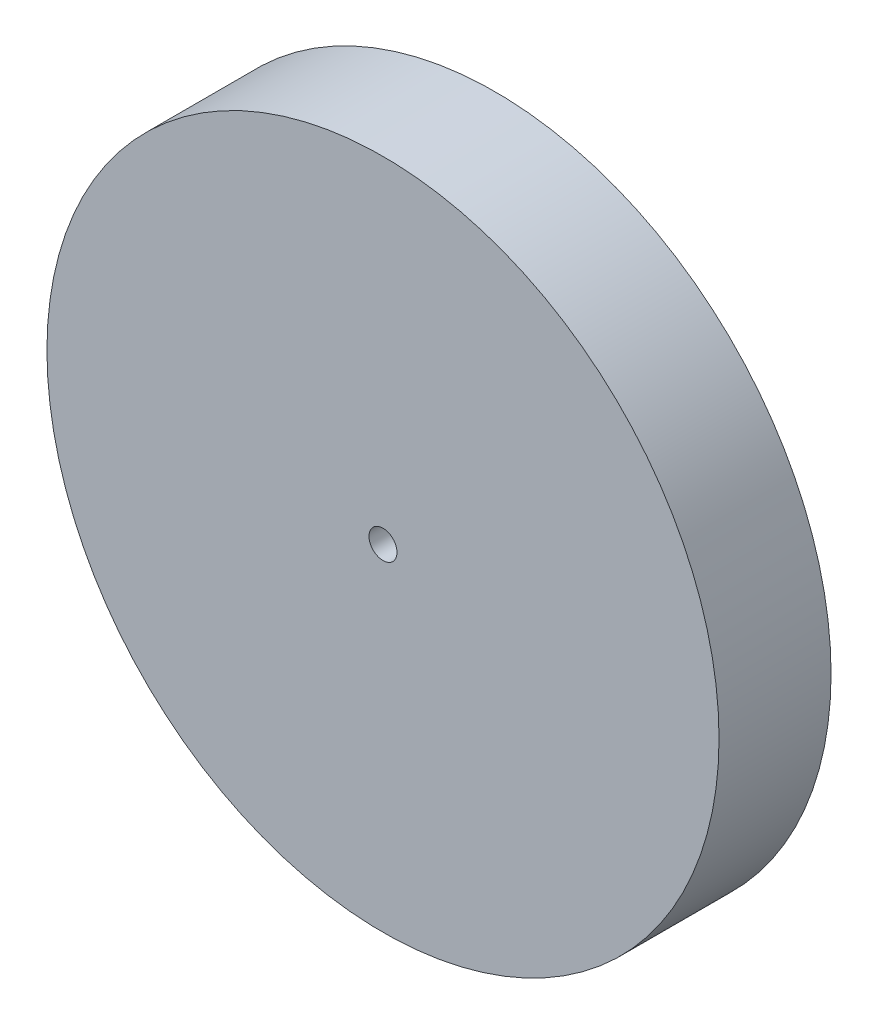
ISO-10303-21;
HEADER;
FILE_DESCRIPTION(('STEP AP214'),'2;1');
FILE_NAME('part.step','',(''),(''),'','','');
FILE_SCHEMA(('AUTOMOTIVE_DESIGN { 1 0 10303 214 1 1 1 1 }'));
ENDSEC;
DATA;
#1=APPLICATION_CONTEXT('core data for automotive mechanical design processes');
#2=APPLICATION_PROTOCOL_DEFINITION('international standard','automotive_design',2000,#1);
#3=PRODUCT_CONTEXT('',#1,'mechanical');
#4=PRODUCT('Part','Part','',(#3));
#5=PRODUCT_RELATED_PRODUCT_CATEGORY('part','',(#4));
#6=PRODUCT_DEFINITION_FORMATION('','',#4);
#7=PRODUCT_DEFINITION_CONTEXT('part definition',#1,'design');
#8=PRODUCT_DEFINITION('design','',#6,#7);
#9=PRODUCT_DEFINITION_SHAPE('','',#8);
#10=(LENGTH_UNIT() NAMED_UNIT(*) SI_UNIT(.MILLI.,.METRE.));
#11=(NAMED_UNIT(*) PLANE_ANGLE_UNIT() SI_UNIT($,.RADIAN.));
#12=(NAMED_UNIT(*) SI_UNIT($,.STERADIAN.) SOLID_ANGLE_UNIT());
#13=UNCERTAINTY_MEASURE_WITH_UNIT(LENGTH_MEASURE(1.E-05),#10,'distance_accuracy_value','');
#14=(GEOMETRIC_REPRESENTATION_CONTEXT(3) GLOBAL_UNCERTAINTY_ASSIGNED_CONTEXT((#13)) GLOBAL_UNIT_ASSIGNED_CONTEXT((#10,
#11,#12)) REPRESENTATION_CONTEXT('',''));
#15=CARTESIAN_POINT('',(0.,0.,0.));
#16=DIRECTION('',(0.,0.,1.));
#17=DIRECTION('',(1.,0.,0.));
#18=AXIS2_PLACEMENT_3D('',#15,#16,#17);
#19=CARTESIAN_POINT('',(0.,0.,6.35));
#20=DIRECTION('',(0.,0.,-1.));
#21=DIRECTION('',(-1.,0.,0.));
#22=AXIS2_PLACEMENT_3D('',#19,#20,#21);
#23=CYLINDRICAL_SURFACE('',#22,38.1);
#24=CARTESIAN_POINT('',(0.,0.,6.35));
#25=DIRECTION('',(0.,0.,1.));
#26=DIRECTION('',(1.,0.,0.));
#27=AXIS2_PLACEMENT_3D('',#24,#25,#26);
#28=CIRCLE('',#27,38.1);
#29=CARTESIAN_POINT('',(38.1,0.,6.35));
#30=VERTEX_POINT('',#29);
#31=EDGE_CURVE('E10',#30,#30,#28,.T.);
#32=ORIENTED_EDGE('',*,*,#31,.F.);
#33=EDGE_LOOP('',(#32));
#34=FACE_BOUND('',#33,.T.);
#35=CARTESIAN_POINT('',(0.,0.,-6.35));
#36=DIRECTION('',(0.,0.,1.));
#37=DIRECTION('',(1.,0.,0.));
#38=AXIS2_PLACEMENT_3D('',#35,#36,#37);
#39=CIRCLE('',#38,38.1);
#40=CARTESIAN_POINT('',(38.1,0.,-6.35));
#41=VERTEX_POINT('',#40);
#42=EDGE_CURVE('E46',#41,#41,#39,.T.);
#43=ORIENTED_EDGE('',*,*,#42,.T.);
#44=EDGE_LOOP('',(#43));
#45=FACE_BOUND('',#44,.T.);
#46=ADVANCED_FACE('F39',(#34,#45),#23,.T.);
#47=CARTESIAN_POINT('',(0.,0.,6.35));
#48=DIRECTION('',(0.,0.,1.));
#49=DIRECTION('',(1.,0.,0.));
#50=AXIS2_PLACEMENT_3D('',#47,#48,#49);
#51=PLANE('',#50);
#52=CARTESIAN_POINT('',(0.,0.,6.35));
#53=DIRECTION('',(0.,0.,1.));
#54=DIRECTION('',(1.,0.,0.));
#55=AXIS2_PLACEMENT_3D('',#52,#53,#54);
#56=CIRCLE('',#55,1.5875);
#57=CARTESIAN_POINT('',(1.5875,0.,6.35));
#58=VERTEX_POINT('',#57);
#59=EDGE_CURVE('E51',#58,#58,#56,.T.);
#60=ORIENTED_EDGE('',*,*,#59,.F.);
#61=EDGE_LOOP('',(#60));
#62=FACE_BOUND('',#61,.T.);
#63=ORIENTED_EDGE('',*,*,#31,.T.);
#64=EDGE_LOOP('',(#63));
#65=FACE_BOUND('',#64,.T.);
#66=ADVANCED_FACE('F67',(#62,#65),#51,.T.);
#67=CARTESIAN_POINT('',(0.,0.,-6.35));
#68=DIRECTION('',(0.,0.,1.));
#69=DIRECTION('',(1.,0.,0.));
#70=AXIS2_PLACEMENT_3D('',#67,#68,#69);
#71=PLANE('',#70);
#72=CARTESIAN_POINT('',(0.,0.,-6.35));
#73=DIRECTION('',(0.,0.,1.));
#74=DIRECTION('',(1.,0.,0.));
#75=AXIS2_PLACEMENT_3D('',#72,#73,#74);
#76=CIRCLE('',#75,1.5875);
#77=CARTESIAN_POINT('',(1.5875,0.,-6.35));
#78=VERTEX_POINT('',#77);
#79=EDGE_CURVE('E45',#78,#78,#76,.T.);
#80=ORIENTED_EDGE('',*,*,#79,.T.);
#81=EDGE_LOOP('',(#80));
#82=FACE_BOUND('',#81,.T.);
#83=ORIENTED_EDGE('',*,*,#42,.F.);
#84=EDGE_LOOP('',(#83));
#85=FACE_BOUND('',#84,.T.);
#86=ADVANCED_FACE('F56',(#82,#85),#71,.F.);
#87=CARTESIAN_POINT('',(0.,0.,-12.7));
#88=DIRECTION('',(0.,0.,1.));
#89=DIRECTION('',(1.,0.,0.));
#90=AXIS2_PLACEMENT_3D('',#87,#88,#89);
#91=CYLINDRICAL_SURFACE('',#90,1.5875);
#92=ORIENTED_EDGE('',*,*,#59,.T.);
#93=EDGE_LOOP('',(#92));
#94=FACE_BOUND('',#93,.T.);
#95=ORIENTED_EDGE('',*,*,#79,.F.);
#96=EDGE_LOOP('',(#95));
#97=FACE_BOUND('',#96,.T.);
#98=ADVANCED_FACE('F65',(#94,#97),#91,.F.);
#99=CLOSED_SHELL('',(#46,#66,#86,#98));
#100=MANIFOLD_SOLID_BREP('B2',#99);
#101=ADVANCED_BREP_SHAPE_REPRESENTATION('',(#18,#100),#14);
#102=SHAPE_DEFINITION_REPRESENTATION(#9,#101);
ENDSEC;
END-ISO-10303-21;
